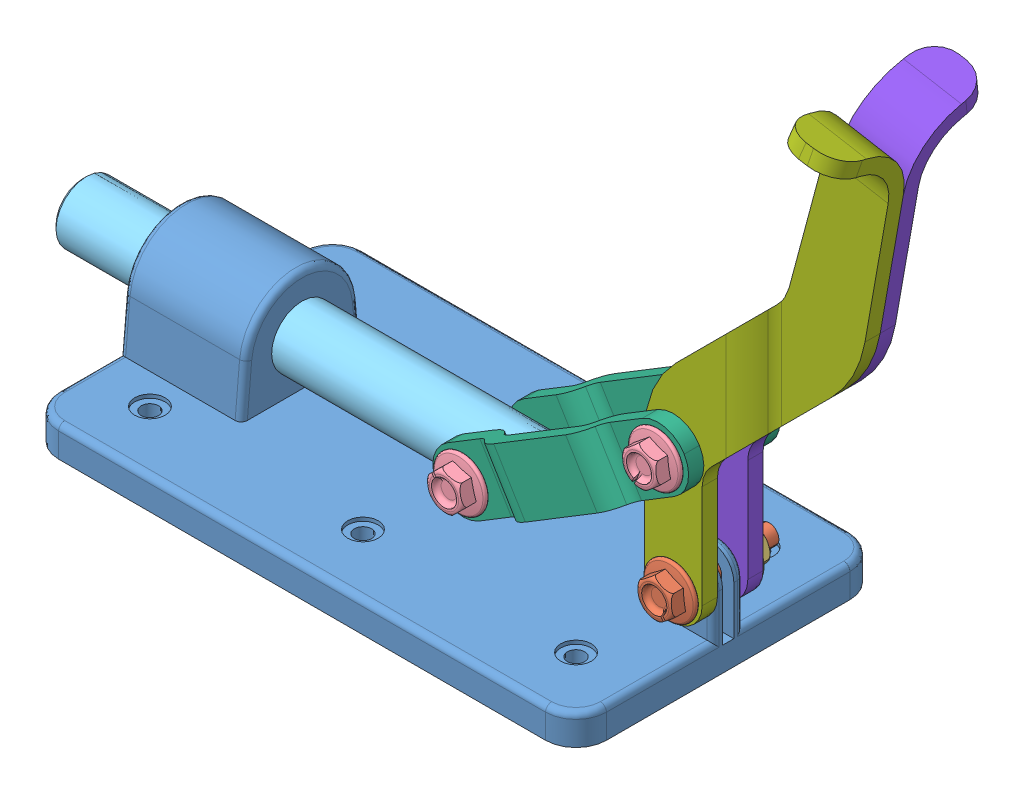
SolidWorks assembly plunger.sldasm, configuration AltPosition_Default_1 (file format 8000). Lengths in mm.
Overall size (173.46 119.69 63.5).
12 component instances, 8 part files, 27 mates.
Components (placement in the parent):
- base_plunger-1: base_plunger.sldprt [Default] at origin
- short bolt_plunger-1: short bolt_plunger.sldprt [Default] at (109.22 15.24 6.35) x (0.598617 -0.801035 0) z (0 0 1)
- nut_plunger-1: nut_plunger.sldprt [Default] at (109.22 15.24 -6.35) x (-0.923728 -0.383049 0) z (0 0 -1)
- long bolt_plunger-1: long bolt_plunger.sldprt [Default] at (109.22 40.64 9.525) x (-0.358847 -0.933396 0) z (0 0 1)
- nut_plunger-2: nut_plunger.sldprt [Default] at (109.22 40.64 -9.525) x (0.937093 -0.349079 0) z (0 0 -1)
- long bolt_plunger-2: long bolt_plunger.sldprt [Default] at (68.5403 15.875 9.525) x (-0.700643 0.713512 0) z (0 0 1)
- nut_plunger-3: nut_plunger.sldprt [Default] at (68.5403 15.875 -9.525) x (-0.077903 -0.996961 0) z (0 0 -1)
- plunger-1: plunger.sldprt [Default] at (-20.3597 15.875 0)
- link_plunger-1: link_plunger.sldprt [Default] at (88.8802 28.2575 6.35) x (0.854166 0.52 0) z (0 0 1)
- link_plunger-2: link_plunger.sldprt [Default] at (88.8802 28.2575 -6.35) x (0.854166 0.52 0) z (0 0 -1)
- arm left-1: arm left.sldprt [Default] at (109.22 15.24 3.175) x (0 -1 0) z (0 0 1)
- arm right-1: arm right.sldprt [Default] at (109.22 15.24 -3.175) x (0 -1 0) z (0 0 1)
Mates (geometry in assembly coordinates):
- Concentric1: concentric aligned: cylinder of base_plunger-1 through (109.22 15.24 3.175) axis (0 0 1) radius 2.54; cylinder of short bolt_plunger-1 through (109.22 15.24 -13.65) axis (0 0 1) radius 2
- Coincident1: coincident anti-aligned: plane of base_plunger-1 through (109.22 15.24 3.175) normal (0 0 1); plane of arm left-1 through (103.22 -120.323 3.175) normal (0 0 -1)
- Concentric2: concentric anti-aligned: cylinder of arm right-1 through (109.22 15.24 0) axis (0 0 -1) radius 2.3813; cylinder of short bolt_plunger-1 through (109.22 15.24 -13.65) axis (0 0 1) radius 2
- Coincident2: coincident anti-aligned: plane of base_plunger-1 through (109.22 15.24 -3.175) normal (0 0 -1); plane of arm right-1 through (103.22 -120.323 -3.175) normal (0 0 1)
- Coincident4: coincident anti-aligned: plane of link_plunger-1 through (111.342 49.366 6.35) normal (0 0 -1); plane of arm left-1 through (109.22 15.24 6.35) normal (0 0 1)
- Coincident5: coincident anti-aligned: plane of arm right-1 through (109.22 15.24 -6.35) normal (0 0 -1); plane of link_plunger-2 through (117.946 38.518 -6.35) normal (0 0 1)
- Concentric4: concentric anti-aligned: cylinder of link_plunger-2 through (109.22 40.64 -6.35) axis (0 0 -1) radius 2.3813; cylinder of long bolt_plunger-1 through (109.22 40.64 -15.475) axis (0 0 1) radius 2
- Concentric5: concentric aligned: cylinder of link_plunger-1 through (68.5403 15.875 6.35) axis (0 0 1) radius 2.3813; cylinder of long bolt_plunger-2 through (68.5403 15.875 -15.475) axis (0 0 1) radius 2
- Concentric6: concentric anti-aligned: cylinder of base_plunger-1 through (25.4 15.875 0) axis (1 0 0) radius 6.35; cylinder of plunger-1 through (74.8903 15.875 0) axis (-1 0 0) radius 6.35
- Concentric7: concentric aligned: cylinder of plunger-1 through (68.5403 15.875 -6.35) axis (0 0 1) radius 2.3813; cylinder of long bolt_plunger-2 through (68.5403 15.875 -15.475) axis (0 0 1) radius 2
- Concentric8: concentric aligned: cylinder of long bolt_plunger-1 through (109.22 40.64 -15.475) axis (0 0 1) radius 2; cylinder of link_plunger-1 through (109.22 40.64 6.35) axis (0 0 1) radius 2.3813
- Concentric9: concentric anti-aligned: cylinder of long bolt_plunger-1 through (109.22 40.64 -15.475) axis (0 0 1) radius 2; cylinder of nut_plunger-2 through (109.22 40.64 -9.525) axis (0 0 -1) radius 2.04
- Concentric10: concentric aligned: cylinder of long bolt_plunger-2 through (68.5403 15.875 -15.475) axis (0 0 1) radius 2; cylinder of link_plunger-1 through (68.5403 15.875 6.35) axis (0 0 1) radius 2.3813
- Concentric11: concentric anti-aligned: cylinder of long bolt_plunger-2 through (68.5403 15.875 -15.475) axis (0 0 1) radius 2; cylinder of nut_plunger-3 through (68.5403 15.875 -9.525) axis (0 0 -1) radius 2.04
- Coincident6: coincident anti-aligned: plane of nut_plunger-2 through (107.8092 36.8528 -9.525) normal (0 0 1); plane of link_plunger-2 through (117.946 38.518 -9.525) normal (0 0 -1)
- Coincident7: coincident anti-aligned: plane of long bolt_plunger-1 through (112.9923 39.1897 9.525) normal (0 0 -1); plane of link_plunger-1 through (111.342 49.366 9.525) normal (0 0 1)
- Coincident8: coincident anti-aligned: plane of nut_plunger-3 through (64.5112 16.1898 -9.525) normal (0 0 1); plane of link_plunger-2 through (66.4184 7.149 -9.525) normal (0 0 -1)
- Coincident9: coincident anti-aligned: plane of long bolt_plunger-2 through (65.6567 13.0434 9.525) normal (0 0 -1); plane of link_plunger-1 through (59.8144 17.997 9.525) normal (0 0 1)
- Concentric12: concentric aligned: cylinder of short bolt_plunger-1 through (109.22 15.24 -13.65) axis (0 0 1) radius 2; cylinder of arm left-1 through (109.22 15.24 0) axis (0 0 1) radius 2.3813
- Coincident10: coincident anti-aligned: plane of short bolt_plunger-1 through (112.4573 17.6593 6.35) normal (0 0 -1); plane of arm left-1 through (109.22 15.24 6.35) normal (0 0 1)
- Concentric13: concentric anti-aligned: cylinder of short bolt_plunger-1 through (109.22 15.24 -13.65) axis (0 0 1) radius 2; cylinder of nut_plunger-1 through (109.22 15.24 -6.35) axis (0 0 -1) radius 2.04
- Coincident11: coincident anti-aligned: plane of nut_plunger-1 through (107.6719 18.9732 -6.35) normal (0 0 1); plane of arm right-1 through (109.22 15.24 -6.35) normal (0 0 -1)
- Concentric14: concentric aligned: cylinder of long bolt_plunger-1 through (109.22 40.64 -15.475) axis (0 0 1) radius 2; cylinder of arm left-1 through (109.22 40.64 0) axis (0 0 1) radius 2.3813
- Coincident12: coincident anti-aligned: plane of arm left-1 through (109.22 15.24 0) normal (0 0 -1); plane of arm right-1 through (109.22 15.24 0) normal (0 0 1)
- Concentric15: concentric anti-aligned: cylinder of long bolt_plunger-2 through (68.5403 15.875 -15.475) axis (0 0 1) radius 2; cylinder of link_plunger-2 through (68.5403 15.875 -6.35) axis (0 0 -1) radius 2.3813
- Concentric16: concentric anti-aligned: cylinder of long bolt_plunger-1 through (109.22 40.64 -15.475) axis (0 0 1) radius 2; cylinder of arm right-1 through (109.22 40.64 0) axis (0 0 -1) radius 2.3813
- Perpendicular1: perpendicular: plane of base_plunger-1 through (0 0 31.75) normal (0 -1 0); plane of arm left-1 through (115.22 15.24 6.35) normal (1 0 0)
